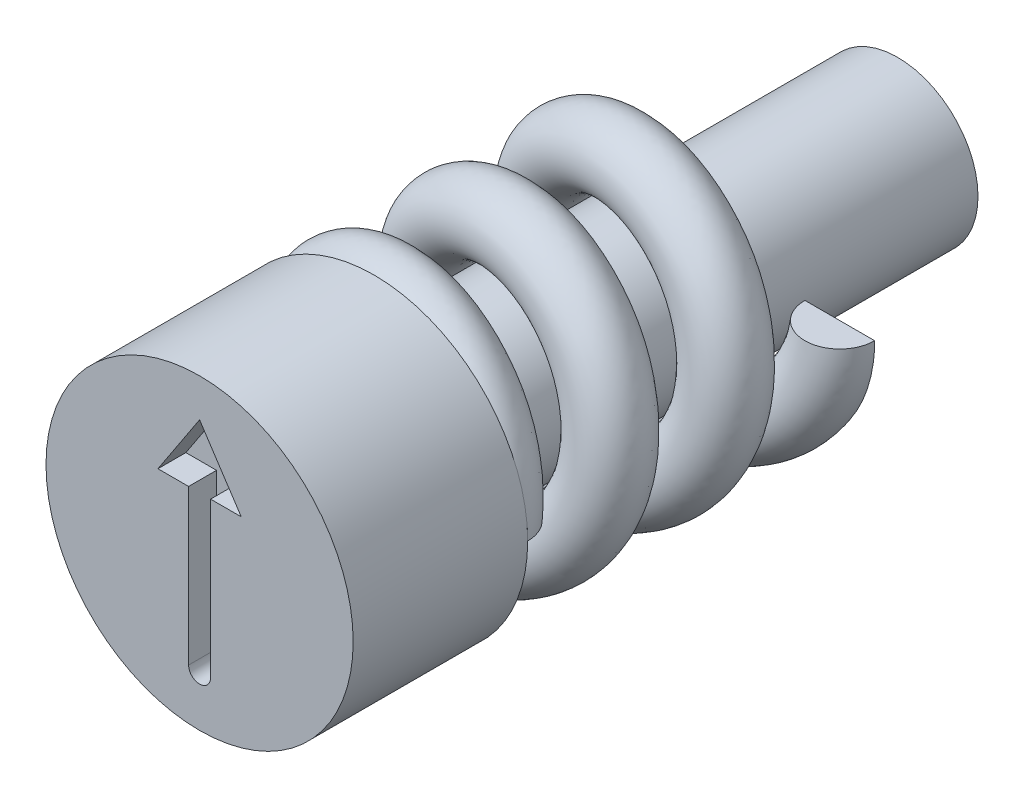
ISO-10303-21;
HEADER;
FILE_DESCRIPTION(('STEP AP214'),'2;1');
FILE_NAME('part.step','',(''),(''),'','','');
FILE_SCHEMA(('AUTOMOTIVE_DESIGN { 1 0 10303 214 1 1 1 1 }'));
ENDSEC;
DATA;
#1=APPLICATION_CONTEXT('core data for automotive mechanical design processes');
#2=APPLICATION_PROTOCOL_DEFINITION('international standard','automotive_design',2000,#1);
#3=PRODUCT_CONTEXT('',#1,'mechanical');
#4=PRODUCT('Part','Part','',(#3));
#5=PRODUCT_RELATED_PRODUCT_CATEGORY('part','',(#4));
#6=PRODUCT_DEFINITION_FORMATION('','',#4);
#7=PRODUCT_DEFINITION_CONTEXT('part definition',#1,'design');
#8=PRODUCT_DEFINITION('design','',#6,#7);
#9=PRODUCT_DEFINITION_SHAPE('','',#8);
#10=(LENGTH_UNIT() NAMED_UNIT(*) SI_UNIT(.MILLI.,.METRE.));
#11=(NAMED_UNIT(*) PLANE_ANGLE_UNIT() SI_UNIT($,.RADIAN.));
#12=(NAMED_UNIT(*) SI_UNIT($,.STERADIAN.) SOLID_ANGLE_UNIT());
#13=UNCERTAINTY_MEASURE_WITH_UNIT(LENGTH_MEASURE(1.E-05),#10,'distance_accuracy_value','');
#14=(GEOMETRIC_REPRESENTATION_CONTEXT(3) GLOBAL_UNCERTAINTY_ASSIGNED_CONTEXT((#13)) GLOBAL_UNIT_ASSIGNED_CONTEXT((#10,
#11,#12)) REPRESENTATION_CONTEXT('',''));
#15=CARTESIAN_POINT('',(0.,0.,0.));
#16=DIRECTION('',(0.,0.,1.));
#17=DIRECTION('',(1.,0.,0.));
#18=AXIS2_PLACEMENT_3D('',#15,#16,#17);
#19=CARTESIAN_POINT('',(1.7,0.,-7.97));
#20=DIRECTION('',(0.,-1.,0.));
#21=DIRECTION('',(0.,0.,-1.));
#22=AXIS2_PLACEMENT_3D('',#19,#20,#21);
#23=PLANE('',#22);
#24=CARTESIAN_POINT('',(1.7,0.,-7.47));
#25=DIRECTION('',(0.,1.,0.));
#26=DIRECTION('',(0.,0.,1.));
#27=AXIS2_PLACEMENT_3D('',#24,#25,#26);
#28=CIRCLE('',#27,0.5);
#29=CARTESIAN_POINT('',(1.2,0.,-7.47));
#30=VERTEX_POINT('',#29);
#31=CARTESIAN_POINT('',(2.2,0.,-7.47));
#32=VERTEX_POINT('',#31);
#33=EDGE_CURVE('E88',#30,#32,#28,.T.);
#34=ORIENTED_EDGE('',*,*,#33,.T.);
#35=DIRECTION('',(-1.,0.,0.));
#36=VECTOR('',#35,1.);
#37=CARTESIAN_POINT('',(1.7,0.,-7.47));
#38=LINE('',#37,#36);
#39=EDGE_CURVE('E75',#32,#30,#38,.T.);
#40=ORIENTED_EDGE('',*,*,#39,.T.);
#41=EDGE_LOOP('',(#34,#40));
#42=FACE_BOUND('',#41,.T.);
#43=ADVANCED_FACE('F49',(#42),#23,.F.);
#44=CARTESIAN_POINT('',(1.7,0.,-3.));
#45=DIRECTION('',(0.,-1.,0.));
#46=DIRECTION('',(0.,0.,-1.));
#47=AXIS2_PLACEMENT_3D('',#44,#45,#46);
#48=PLANE('',#47);
#49=DIRECTION('',(1.,0.,0.));
#50=VECTOR('',#49,1.);
#51=CARTESIAN_POINT('',(1.7,0.,-2.5));
#52=LINE('',#51,#50);
#53=CARTESIAN_POINT('',(1.2,0.,-2.5));
#54=VERTEX_POINT('',#53);
#55=CARTESIAN_POINT('',(2.2,0.,-2.5));
#56=VERTEX_POINT('',#55);
#57=EDGE_CURVE('E69',#54,#56,#52,.T.);
#58=ORIENTED_EDGE('',*,*,#57,.F.);
#59=CARTESIAN_POINT('',(1.7,0.,-2.5));
#60=DIRECTION('',(0.,-1.,0.));
#61=DIRECTION('',(0.,0.,-1.));
#62=AXIS2_PLACEMENT_3D('',#59,#60,#61);
#63=CIRCLE('',#62,0.5);
#64=EDGE_CURVE('E85',#54,#56,#63,.T.);
#65=ORIENTED_EDGE('',*,*,#64,.T.);
#66=EDGE_LOOP('',(#58,#65));
#67=FACE_BOUND('',#66,.T.);
#68=ADVANCED_FACE('F51',(#67),#48,.T.);
#69=CARTESIAN_POINT('',(1.7,0.,-6.97));
#70=CARTESIAN_POINT('',(1.7,-0.704163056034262,-6.86645833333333));
#71=CARTESIAN_POINT('',(1.20208152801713,-1.20208152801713,-6.76291666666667));
#72=CARTESIAN_POINT('',(0.704163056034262,-1.7,-6.659375));
#73=CARTESIAN_POINT('',(0.,-1.7,-6.55583333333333));
#74=CARTESIAN_POINT('',(-0.704163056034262,-1.7,-6.45229166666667));
#75=CARTESIAN_POINT('',(-1.20208152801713,-1.20208152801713,-6.34875));
#76=CARTESIAN_POINT('',(-1.7,-0.704163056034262,-6.24520833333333));
#77=CARTESIAN_POINT('',(-1.7,0.,-6.14166666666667));
#78=CARTESIAN_POINT('',(-1.7,0.704163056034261,-6.038125));
#79=CARTESIAN_POINT('',(-1.20208152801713,1.20208152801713,-5.93458333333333));
#80=CARTESIAN_POINT('',(-0.704163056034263,1.7,-5.83104166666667));
#81=CARTESIAN_POINT('',(0.,1.7,-5.7275));
#82=CARTESIAN_POINT('',(0.704163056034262,1.7,-5.62395833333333));
#83=CARTESIAN_POINT('',(1.20208152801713,1.20208152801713,-5.52041666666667));
#84=CARTESIAN_POINT('',(1.7,0.704163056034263,-5.416875));
#85=CARTESIAN_POINT('',(1.7,0.,-5.31333333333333));
#86=CARTESIAN_POINT('',(1.7,-0.704163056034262,-5.20979166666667));
#87=CARTESIAN_POINT('',(1.20208152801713,-1.20208152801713,-5.10625));
#88=CARTESIAN_POINT('',(0.704163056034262,-1.7,-5.00270833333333));
#89=CARTESIAN_POINT('',(0.,-1.7,-4.89916666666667));
#90=CARTESIAN_POINT('',(-0.704163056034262,-1.7,-4.795625));
#91=CARTESIAN_POINT('',(-1.20208152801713,-1.20208152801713,-4.69208333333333));
#92=CARTESIAN_POINT('',(-1.7,-0.704163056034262,-4.58854166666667));
#93=CARTESIAN_POINT('',(-1.7,0.,-4.485));
#94=CARTESIAN_POINT('',(-1.7,0.704163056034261,-4.38145833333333));
#95=CARTESIAN_POINT('',(-1.20208152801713,1.20208152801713,-4.27791666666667));
#96=CARTESIAN_POINT('',(-0.704163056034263,1.7,-4.174375));
#97=CARTESIAN_POINT('',(0.,1.7,-4.07083333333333));
#98=CARTESIAN_POINT('',(0.704163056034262,1.7,-3.96729166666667));
#99=CARTESIAN_POINT('',(1.20208152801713,1.20208152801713,-3.86375));
#100=CARTESIAN_POINT('',(1.7,0.704163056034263,-3.76020833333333));
#101=CARTESIAN_POINT('',(1.7,0.,-3.65666666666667));
#102=CARTESIAN_POINT('',(1.7,-0.704163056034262,-3.553125));
#103=CARTESIAN_POINT('',(1.20208152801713,-1.20208152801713,-3.44958333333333));
#104=CARTESIAN_POINT('',(0.704163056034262,-1.7,-3.34604166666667));
#105=CARTESIAN_POINT('',(0.,-1.7,-3.2425));
#106=CARTESIAN_POINT('',(-0.704163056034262,-1.7,-3.13895833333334));
#107=CARTESIAN_POINT('',(-1.20208152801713,-1.20208152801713,-3.03541666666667));
#108=CARTESIAN_POINT('',(-1.7,-0.704163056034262,-2.931875));
#109=CARTESIAN_POINT('',(-1.7,0.,-2.82833333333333));
#110=CARTESIAN_POINT('',(-1.7,0.704163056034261,-2.72479166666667));
#111=CARTESIAN_POINT('',(-1.20208152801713,1.20208152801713,-2.62125));
#112=CARTESIAN_POINT('',(-0.704163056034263,1.7,-2.51770833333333));
#113=CARTESIAN_POINT('',(0.,1.7,-2.41416666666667));
#114=CARTESIAN_POINT('',(0.704163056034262,1.7,-2.310625));
#115=CARTESIAN_POINT('',(1.20208152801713,1.20208152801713,-2.20708333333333));
#116=CARTESIAN_POINT('',(1.7,0.704163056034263,-2.10354166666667));
#117=CARTESIAN_POINT('',(1.7,0.,-2.));
#118=CARTESIAN_POINT('',(2.7,0.,-6.97));
#119=CARTESIAN_POINT('',(2.7,-1.11837661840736,-6.86645833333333));
#120=CARTESIAN_POINT('',(1.90918830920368,-1.90918830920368,-6.76291666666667));
#121=CARTESIAN_POINT('',(1.11837661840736,-2.7,-6.659375));
#122=CARTESIAN_POINT('',(0.,-2.7,-6.55583333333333));
#123=CARTESIAN_POINT('',(-1.11837661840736,-2.7,-6.45229166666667));
#124=CARTESIAN_POINT('',(-1.90918830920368,-1.90918830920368,-6.34875));
#125=CARTESIAN_POINT('',(-2.7,-1.11837661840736,-6.24520833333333));
#126=CARTESIAN_POINT('',(-2.7,0.,-6.14166666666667));
#127=CARTESIAN_POINT('',(-2.7,1.11837661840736,-6.038125));
#128=CARTESIAN_POINT('',(-1.90918830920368,1.90918830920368,-5.93458333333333));
#129=CARTESIAN_POINT('',(-1.11837661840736,2.7,-5.83104166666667));
#130=CARTESIAN_POINT('',(0.,2.7,-5.7275));
#131=CARTESIAN_POINT('',(1.11837661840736,2.7,-5.62395833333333));
#132=CARTESIAN_POINT('',(1.90918830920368,1.90918830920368,-5.52041666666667));
#133=CARTESIAN_POINT('',(2.7,1.11837661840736,-5.416875));
#134=CARTESIAN_POINT('',(2.7,0.,-5.31333333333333));
#135=CARTESIAN_POINT('',(2.7,-1.11837661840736,-5.20979166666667));
#136=CARTESIAN_POINT('',(1.90918830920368,-1.90918830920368,-5.10625));
#137=CARTESIAN_POINT('',(1.11837661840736,-2.7,-5.00270833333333));
#138=CARTESIAN_POINT('',(0.,-2.7,-4.89916666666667));
#139=CARTESIAN_POINT('',(-1.11837661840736,-2.7,-4.795625));
#140=CARTESIAN_POINT('',(-1.90918830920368,-1.90918830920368,-4.69208333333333));
#141=CARTESIAN_POINT('',(-2.7,-1.11837661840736,-4.58854166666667));
#142=CARTESIAN_POINT('',(-2.7,0.,-4.485));
#143=CARTESIAN_POINT('',(-2.7,1.11837661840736,-4.38145833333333));
#144=CARTESIAN_POINT('',(-1.90918830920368,1.90918830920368,-4.27791666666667));
#145=CARTESIAN_POINT('',(-1.11837661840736,2.7,-4.174375));
#146=CARTESIAN_POINT('',(0.,2.7,-4.07083333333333));
#147=CARTESIAN_POINT('',(1.11837661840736,2.7,-3.96729166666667));
#148=CARTESIAN_POINT('',(1.90918830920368,1.90918830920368,-3.86375));
#149=CARTESIAN_POINT('',(2.7,1.11837661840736,-3.76020833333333));
#150=CARTESIAN_POINT('',(2.7,0.,-3.65666666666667));
#151=CARTESIAN_POINT('',(2.7,-1.11837661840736,-3.553125));
#152=CARTESIAN_POINT('',(1.90918830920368,-1.90918830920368,-3.44958333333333));
#153=CARTESIAN_POINT('',(1.11837661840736,-2.7,-3.34604166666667));
#154=CARTESIAN_POINT('',(0.,-2.7,-3.2425));
#155=CARTESIAN_POINT('',(-1.11837661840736,-2.7,-3.13895833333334));
#156=CARTESIAN_POINT('',(-1.90918830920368,-1.90918830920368,-3.03541666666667));
#157=CARTESIAN_POINT('',(-2.7,-1.11837661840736,-2.931875));
#158=CARTESIAN_POINT('',(-2.7,0.,-2.82833333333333));
#159=CARTESIAN_POINT('',(-2.7,1.11837661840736,-2.72479166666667));
#160=CARTESIAN_POINT('',(-1.90918830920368,1.90918830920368,-2.62125));
#161=CARTESIAN_POINT('',(-1.11837661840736,2.7,-2.51770833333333));
#162=CARTESIAN_POINT('',(0.,2.7,-2.41416666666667));
#163=CARTESIAN_POINT('',(1.11837661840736,2.7,-2.310625));
#164=CARTESIAN_POINT('',(1.90918830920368,1.90918830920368,-2.20708333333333));
#165=CARTESIAN_POINT('',(2.7,1.11837661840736,-2.10354166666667));
#166=CARTESIAN_POINT('',(2.7,0.,-2.));
#167=CARTESIAN_POINT('',(2.7,0.,-7.97));
#168=CARTESIAN_POINT('',(2.7,-1.11837661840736,-7.86645833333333));
#169=CARTESIAN_POINT('',(1.90918830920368,-1.90918830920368,-7.76291666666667));
#170=CARTESIAN_POINT('',(1.11837661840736,-2.7,-7.659375));
#171=CARTESIAN_POINT('',(0.,-2.7,-7.55583333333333));
#172=CARTESIAN_POINT('',(-1.11837661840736,-2.7,-7.45229166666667));
#173=CARTESIAN_POINT('',(-1.90918830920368,-1.90918830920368,-7.34875));
#174=CARTESIAN_POINT('',(-2.7,-1.11837661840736,-7.24520833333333));
#175=CARTESIAN_POINT('',(-2.7,0.,-7.14166666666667));
#176=CARTESIAN_POINT('',(-2.7,1.11837661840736,-7.038125));
#177=CARTESIAN_POINT('',(-1.90918830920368,1.90918830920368,-6.93458333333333));
#178=CARTESIAN_POINT('',(-1.11837661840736,2.7,-6.83104166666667));
#179=CARTESIAN_POINT('',(0.,2.7,-6.7275));
#180=CARTESIAN_POINT('',(1.11837661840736,2.7,-6.62395833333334));
#181=CARTESIAN_POINT('',(1.90918830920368,1.90918830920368,-6.52041666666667));
#182=CARTESIAN_POINT('',(2.7,1.11837661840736,-6.416875));
#183=CARTESIAN_POINT('',(2.7,0.,-6.31333333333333));
#184=CARTESIAN_POINT('',(2.7,-1.11837661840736,-6.20979166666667));
#185=CARTESIAN_POINT('',(1.90918830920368,-1.90918830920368,-6.10625));
#186=CARTESIAN_POINT('',(1.11837661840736,-2.7,-6.00270833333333));
#187=CARTESIAN_POINT('',(0.,-2.7,-5.89916666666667));
#188=CARTESIAN_POINT('',(-1.11837661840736,-2.7,-5.795625));
#189=CARTESIAN_POINT('',(-1.90918830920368,-1.90918830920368,-5.69208333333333));
#190=CARTESIAN_POINT('',(-2.7,-1.11837661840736,-5.58854166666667));
#191=CARTESIAN_POINT('',(-2.7,0.,-5.485));
#192=CARTESIAN_POINT('',(-2.7,1.11837661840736,-5.38145833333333));
#193=CARTESIAN_POINT('',(-1.90918830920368,1.90918830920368,-5.27791666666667));
#194=CARTESIAN_POINT('',(-1.11837661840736,2.7,-5.174375));
#195=CARTESIAN_POINT('',(0.,2.7,-5.07083333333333));
#196=CARTESIAN_POINT('',(1.11837661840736,2.7,-4.96729166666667));
#197=CARTESIAN_POINT('',(1.90918830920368,1.90918830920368,-4.86375));
#198=CARTESIAN_POINT('',(2.7,1.11837661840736,-4.76020833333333));
#199=CARTESIAN_POINT('',(2.7,0.,-4.65666666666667));
#200=CARTESIAN_POINT('',(2.7,-1.11837661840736,-4.553125));
#201=CARTESIAN_POINT('',(1.90918830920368,-1.90918830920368,-4.44958333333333));
#202=CARTESIAN_POINT('',(1.11837661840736,-2.7,-4.34604166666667));
#203=CARTESIAN_POINT('',(0.,-2.7,-4.2425));
#204=CARTESIAN_POINT('',(-1.11837661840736,-2.7,-4.13895833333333));
#205=CARTESIAN_POINT('',(-1.90918830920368,-1.90918830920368,-4.03541666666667));
#206=CARTESIAN_POINT('',(-2.7,-1.11837661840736,-3.931875));
#207=CARTESIAN_POINT('',(-2.7,0.,-3.82833333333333));
#208=CARTESIAN_POINT('',(-2.7,1.11837661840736,-3.72479166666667));
#209=CARTESIAN_POINT('',(-1.90918830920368,1.90918830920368,-3.62125));
#210=CARTESIAN_POINT('',(-1.11837661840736,2.7,-3.51770833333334));
#211=CARTESIAN_POINT('',(0.,2.7,-3.41416666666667));
#212=CARTESIAN_POINT('',(1.11837661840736,2.7,-3.310625));
#213=CARTESIAN_POINT('',(1.90918830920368,1.90918830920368,-3.20708333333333));
#214=CARTESIAN_POINT('',(2.7,1.11837661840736,-3.10354166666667));
#215=CARTESIAN_POINT('',(2.7,0.,-3.));
#216=CARTESIAN_POINT('',(1.7,0.,-7.97));
#217=CARTESIAN_POINT('',(1.7,-0.704163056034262,-7.86645833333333));
#218=CARTESIAN_POINT('',(1.20208152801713,-1.20208152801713,-7.76291666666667));
#219=CARTESIAN_POINT('',(0.704163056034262,-1.7,-7.659375));
#220=CARTESIAN_POINT('',(0.,-1.7,-7.55583333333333));
#221=CARTESIAN_POINT('',(-0.704163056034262,-1.7,-7.45229166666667));
#222=CARTESIAN_POINT('',(-1.20208152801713,-1.20208152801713,-7.34875));
#223=CARTESIAN_POINT('',(-1.7,-0.704163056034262,-7.24520833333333));
#224=CARTESIAN_POINT('',(-1.7,0.,-7.14166666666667));
#225=CARTESIAN_POINT('',(-1.7,0.704163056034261,-7.038125));
#226=CARTESIAN_POINT('',(-1.20208152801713,1.20208152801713,-6.93458333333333));
#227=CARTESIAN_POINT('',(-0.704163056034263,1.7,-6.83104166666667));
#228=CARTESIAN_POINT('',(0.,1.7,-6.7275));
#229=CARTESIAN_POINT('',(0.704163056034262,1.7,-6.62395833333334));
#230=CARTESIAN_POINT('',(1.20208152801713,1.20208152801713,-6.52041666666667));
#231=CARTESIAN_POINT('',(1.7,0.704163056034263,-6.416875));
#232=CARTESIAN_POINT('',(1.7,0.,-6.31333333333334));
#233=CARTESIAN_POINT('',(1.7,-0.704163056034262,-6.20979166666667));
#234=CARTESIAN_POINT('',(1.20208152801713,-1.20208152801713,-6.10625));
#235=CARTESIAN_POINT('',(0.704163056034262,-1.7,-6.00270833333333));
#236=CARTESIAN_POINT('',(0.,-1.7,-5.89916666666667));
#237=CARTESIAN_POINT('',(-0.704163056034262,-1.7,-5.795625));
#238=CARTESIAN_POINT('',(-1.20208152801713,-1.20208152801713,-5.69208333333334));
#239=CARTESIAN_POINT('',(-1.7,-0.704163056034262,-5.58854166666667));
#240=CARTESIAN_POINT('',(-1.7,0.,-5.485));
#241=CARTESIAN_POINT('',(-1.7,0.704163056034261,-5.38145833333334));
#242=CARTESIAN_POINT('',(-1.20208152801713,1.20208152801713,-5.27791666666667));
#243=CARTESIAN_POINT('',(-0.704163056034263,1.7,-5.174375));
#244=CARTESIAN_POINT('',(0.,1.7,-5.07083333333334));
#245=CARTESIAN_POINT('',(0.704163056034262,1.7,-4.96729166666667));
#246=CARTESIAN_POINT('',(1.20208152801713,1.20208152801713,-4.86375));
#247=CARTESIAN_POINT('',(1.7,0.704163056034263,-4.76020833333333));
#248=CARTESIAN_POINT('',(1.7,0.,-4.65666666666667));
#249=CARTESIAN_POINT('',(1.7,-0.704163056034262,-4.553125));
#250=CARTESIAN_POINT('',(1.20208152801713,-1.20208152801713,-4.44958333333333));
#251=CARTESIAN_POINT('',(0.704163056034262,-1.7,-4.34604166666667));
#252=CARTESIAN_POINT('',(0.,-1.7,-4.2425));
#253=CARTESIAN_POINT('',(-0.704163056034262,-1.7,-4.13895833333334));
#254=CARTESIAN_POINT('',(-1.20208152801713,-1.20208152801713,-4.03541666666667));
#255=CARTESIAN_POINT('',(-1.7,-0.704163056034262,-3.931875));
#256=CARTESIAN_POINT('',(-1.7,0.,-3.82833333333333));
#257=CARTESIAN_POINT('',(-1.7,0.704163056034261,-3.72479166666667));
#258=CARTESIAN_POINT('',(-1.20208152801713,1.20208152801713,-3.62125));
#259=CARTESIAN_POINT('',(-0.704163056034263,1.7,-3.51770833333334));
#260=CARTESIAN_POINT('',(0.,1.7,-3.41416666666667));
#261=CARTESIAN_POINT('',(0.704163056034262,1.7,-3.310625));
#262=CARTESIAN_POINT('',(1.20208152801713,1.20208152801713,-3.20708333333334));
#263=CARTESIAN_POINT('',(1.7,0.704163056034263,-3.10354166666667));
#264=CARTESIAN_POINT('',(1.7,0.,-3.));
#265=CARTESIAN_POINT('',(0.7,0.,-7.97));
#266=CARTESIAN_POINT('',(0.7,-0.289949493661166,-7.86645833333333));
#267=CARTESIAN_POINT('',(0.494974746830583,-0.494974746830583,-7.76291666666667));
#268=CARTESIAN_POINT('',(0.289949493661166,-0.7,-7.659375));
#269=CARTESIAN_POINT('',(0.,-0.7,-7.55583333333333));
#270=CARTESIAN_POINT('',(-0.289949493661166,-0.7,-7.45229166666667));
#271=CARTESIAN_POINT('',(-0.494974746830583,-0.494974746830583,-7.34875));
#272=CARTESIAN_POINT('',(-0.7,-0.289949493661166,-7.24520833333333));
#273=CARTESIAN_POINT('',(-0.7,0.,-7.14166666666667));
#274=CARTESIAN_POINT('',(-0.7,0.289949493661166,-7.038125));
#275=CARTESIAN_POINT('',(-0.494974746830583,0.494974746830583,-6.93458333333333));
#276=CARTESIAN_POINT('',(-0.289949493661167,0.7,-6.83104166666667));
#277=CARTESIAN_POINT('',(0.,0.7,-6.7275));
#278=CARTESIAN_POINT('',(0.289949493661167,0.7,-6.62395833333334));
#279=CARTESIAN_POINT('',(0.494974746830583,0.494974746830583,-6.52041666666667));
#280=CARTESIAN_POINT('',(0.7,0.289949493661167,-6.416875));
#281=CARTESIAN_POINT('',(0.7,0.,-6.31333333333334));
#282=CARTESIAN_POINT('',(0.7,-0.289949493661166,-6.20979166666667));
#283=CARTESIAN_POINT('',(0.494974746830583,-0.494974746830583,-6.10625));
#284=CARTESIAN_POINT('',(0.289949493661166,-0.7,-6.00270833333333));
#285=CARTESIAN_POINT('',(0.,-0.7,-5.89916666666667));
#286=CARTESIAN_POINT('',(-0.289949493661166,-0.7,-5.795625));
#287=CARTESIAN_POINT('',(-0.494974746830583,-0.494974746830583,-5.69208333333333));
#288=CARTESIAN_POINT('',(-0.7,-0.289949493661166,-5.58854166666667));
#289=CARTESIAN_POINT('',(-0.7,0.,-5.485));
#290=CARTESIAN_POINT('',(-0.7,0.289949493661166,-5.38145833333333));
#291=CARTESIAN_POINT('',(-0.494974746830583,0.494974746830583,-5.27791666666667));
#292=CARTESIAN_POINT('',(-0.289949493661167,0.7,-5.174375));
#293=CARTESIAN_POINT('',(0.,0.7,-5.07083333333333));
#294=CARTESIAN_POINT('',(0.289949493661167,0.7,-4.96729166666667));
#295=CARTESIAN_POINT('',(0.494974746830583,0.494974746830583,-4.86375));
#296=CARTESIAN_POINT('',(0.7,0.289949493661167,-4.76020833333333));
#297=CARTESIAN_POINT('',(0.7,0.,-4.65666666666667));
#298=CARTESIAN_POINT('',(0.7,-0.289949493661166,-4.553125));
#299=CARTESIAN_POINT('',(0.494974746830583,-0.494974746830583,-4.44958333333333));
#300=CARTESIAN_POINT('',(0.289949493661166,-0.7,-4.34604166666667));
#301=CARTESIAN_POINT('',(0.,-0.7,-4.2425));
#302=CARTESIAN_POINT('',(-0.289949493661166,-0.7,-4.13895833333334));
#303=CARTESIAN_POINT('',(-0.494974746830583,-0.494974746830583,-4.03541666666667));
#304=CARTESIAN_POINT('',(-0.7,-0.289949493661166,-3.931875));
#305=CARTESIAN_POINT('',(-0.7,0.,-3.82833333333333));
#306=CARTESIAN_POINT('',(-0.7,0.289949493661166,-3.72479166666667));
#307=CARTESIAN_POINT('',(-0.494974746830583,0.494974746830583,-3.62125));
#308=CARTESIAN_POINT('',(-0.289949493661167,0.7,-3.51770833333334));
#309=CARTESIAN_POINT('',(0.,0.7,-3.41416666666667));
#310=CARTESIAN_POINT('',(0.289949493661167,0.7,-3.310625));
#311=CARTESIAN_POINT('',(0.494974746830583,0.494974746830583,-3.20708333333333));
#312=CARTESIAN_POINT('',(0.7,0.289949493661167,-3.10354166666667));
#313=CARTESIAN_POINT('',(0.7,0.,-3.));
#314=CARTESIAN_POINT('',(0.7,0.,-6.97));
#315=CARTESIAN_POINT('',(0.7,-0.289949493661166,-6.86645833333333));
#316=CARTESIAN_POINT('',(0.494974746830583,-0.494974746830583,-6.76291666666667));
#317=CARTESIAN_POINT('',(0.289949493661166,-0.7,-6.659375));
#318=CARTESIAN_POINT('',(0.,-0.7,-6.55583333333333));
#319=CARTESIAN_POINT('',(-0.289949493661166,-0.7,-6.45229166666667));
#320=CARTESIAN_POINT('',(-0.494974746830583,-0.494974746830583,-6.34875));
#321=CARTESIAN_POINT('',(-0.7,-0.289949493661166,-6.24520833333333));
#322=CARTESIAN_POINT('',(-0.7,0.,-6.14166666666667));
#323=CARTESIAN_POINT('',(-0.7,0.289949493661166,-6.038125));
#324=CARTESIAN_POINT('',(-0.494974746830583,0.494974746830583,-5.93458333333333));
#325=CARTESIAN_POINT('',(-0.289949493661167,0.7,-5.83104166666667));
#326=CARTESIAN_POINT('',(0.,0.7,-5.7275));
#327=CARTESIAN_POINT('',(0.289949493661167,0.7,-5.62395833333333));
#328=CARTESIAN_POINT('',(0.494974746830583,0.494974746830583,-5.52041666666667));
#329=CARTESIAN_POINT('',(0.7,0.289949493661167,-5.416875));
#330=CARTESIAN_POINT('',(0.7,0.,-5.31333333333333));
#331=CARTESIAN_POINT('',(0.7,-0.289949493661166,-5.20979166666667));
#332=CARTESIAN_POINT('',(0.494974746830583,-0.494974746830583,-5.10625));
#333=CARTESIAN_POINT('',(0.289949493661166,-0.7,-5.00270833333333));
#334=CARTESIAN_POINT('',(0.,-0.7,-4.89916666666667));
#335=CARTESIAN_POINT('',(-0.289949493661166,-0.7,-4.795625));
#336=CARTESIAN_POINT('',(-0.494974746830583,-0.494974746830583,-4.69208333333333));
#337=CARTESIAN_POINT('',(-0.7,-0.289949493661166,-4.58854166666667));
#338=CARTESIAN_POINT('',(-0.7,0.,-4.485));
#339=CARTESIAN_POINT('',(-0.7,0.289949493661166,-4.38145833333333));
#340=CARTESIAN_POINT('',(-0.494974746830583,0.494974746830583,-4.27791666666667));
#341=CARTESIAN_POINT('',(-0.289949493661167,0.7,-4.174375));
#342=CARTESIAN_POINT('',(0.,0.7,-4.07083333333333));
#343=CARTESIAN_POINT('',(0.289949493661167,0.7,-3.96729166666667));
#344=CARTESIAN_POINT('',(0.494974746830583,0.494974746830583,-3.86375));
#345=CARTESIAN_POINT('',(0.7,0.289949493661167,-3.76020833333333));
#346=CARTESIAN_POINT('',(0.7,0.,-3.65666666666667));
#347=CARTESIAN_POINT('',(0.7,-0.289949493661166,-3.553125));
#348=CARTESIAN_POINT('',(0.494974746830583,-0.494974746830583,-3.44958333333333));
#349=CARTESIAN_POINT('',(0.289949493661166,-0.7,-3.34604166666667));
#350=CARTESIAN_POINT('',(0.,-0.7,-3.2425));
#351=CARTESIAN_POINT('',(-0.289949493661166,-0.7,-3.13895833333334));
#352=CARTESIAN_POINT('',(-0.494974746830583,-0.494974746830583,-3.03541666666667));
#353=CARTESIAN_POINT('',(-0.7,-0.289949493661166,-2.931875));
#354=CARTESIAN_POINT('',(-0.7,0.,-2.82833333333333));
#355=CARTESIAN_POINT('',(-0.7,0.289949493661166,-2.72479166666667));
#356=CARTESIAN_POINT('',(-0.494974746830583,0.494974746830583,-2.62125));
#357=CARTESIAN_POINT('',(-0.289949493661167,0.7,-2.51770833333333));
#358=CARTESIAN_POINT('',(0.,0.7,-2.41416666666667));
#359=CARTESIAN_POINT('',(0.289949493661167,0.7,-2.310625));
#360=CARTESIAN_POINT('',(0.494974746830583,0.494974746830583,-2.20708333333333));
#361=CARTESIAN_POINT('',(0.7,0.289949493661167,-2.10354166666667));
#362=CARTESIAN_POINT('',(0.7,0.,-2.));
#363=CARTESIAN_POINT('',(1.7,0.,-6.97));
#364=CARTESIAN_POINT('',(1.7,-0.704163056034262,-6.86645833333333));
#365=CARTESIAN_POINT('',(1.20208152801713,-1.20208152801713,-6.76291666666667));
#366=CARTESIAN_POINT('',(0.704163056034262,-1.7,-6.659375));
#367=CARTESIAN_POINT('',(0.,-1.7,-6.55583333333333));
#368=CARTESIAN_POINT('',(-0.704163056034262,-1.7,-6.45229166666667));
#369=CARTESIAN_POINT('',(-1.20208152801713,-1.20208152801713,-6.34875));
#370=CARTESIAN_POINT('',(-1.7,-0.704163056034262,-6.24520833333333));
#371=CARTESIAN_POINT('',(-1.7,0.,-6.14166666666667));
#372=CARTESIAN_POINT('',(-1.7,0.704163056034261,-6.038125));
#373=CARTESIAN_POINT('',(-1.20208152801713,1.20208152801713,-5.93458333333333));
#374=CARTESIAN_POINT('',(-0.704163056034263,1.7,-5.83104166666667));
#375=CARTESIAN_POINT('',(0.,1.7,-5.7275));
#376=CARTESIAN_POINT('',(0.704163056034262,1.7,-5.62395833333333));
#377=CARTESIAN_POINT('',(1.20208152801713,1.20208152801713,-5.52041666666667));
#378=CARTESIAN_POINT('',(1.7,0.704163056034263,-5.416875));
#379=CARTESIAN_POINT('',(1.7,0.,-5.31333333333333));
#380=CARTESIAN_POINT('',(1.7,-0.704163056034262,-5.20979166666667));
#381=CARTESIAN_POINT('',(1.20208152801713,-1.20208152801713,-5.10625));
#382=CARTESIAN_POINT('',(0.704163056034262,-1.7,-5.00270833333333));
#383=CARTESIAN_POINT('',(0.,-1.7,-4.89916666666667));
#384=CARTESIAN_POINT('',(-0.704163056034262,-1.7,-4.795625));
#385=CARTESIAN_POINT('',(-1.20208152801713,-1.20208152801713,-4.69208333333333));
#386=CARTESIAN_POINT('',(-1.7,-0.704163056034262,-4.58854166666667));
#387=CARTESIAN_POINT('',(-1.7,0.,-4.485));
#388=CARTESIAN_POINT('',(-1.7,0.704163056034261,-4.38145833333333));
#389=CARTESIAN_POINT('',(-1.20208152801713,1.20208152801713,-4.27791666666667));
#390=CARTESIAN_POINT('',(-0.704163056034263,1.7,-4.174375));
#391=CARTESIAN_POINT('',(0.,1.7,-4.07083333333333));
#392=CARTESIAN_POINT('',(0.704163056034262,1.7,-3.96729166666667));
#393=CARTESIAN_POINT('',(1.20208152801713,1.20208152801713,-3.86375));
#394=CARTESIAN_POINT('',(1.7,0.704163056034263,-3.76020833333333));
#395=CARTESIAN_POINT('',(1.7,0.,-3.65666666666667));
#396=CARTESIAN_POINT('',(1.7,-0.704163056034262,-3.553125));
#397=CARTESIAN_POINT('',(1.20208152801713,-1.20208152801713,-3.44958333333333));
#398=CARTESIAN_POINT('',(0.704163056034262,-1.7,-3.34604166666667));
#399=CARTESIAN_POINT('',(0.,-1.7,-3.2425));
#400=CARTESIAN_POINT('',(-0.704163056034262,-1.7,-3.13895833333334));
#401=CARTESIAN_POINT('',(-1.20208152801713,-1.20208152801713,-3.03541666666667));
#402=CARTESIAN_POINT('',(-1.7,-0.704163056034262,-2.931875));
#403=CARTESIAN_POINT('',(-1.7,0.,-2.82833333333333));
#404=CARTESIAN_POINT('',(-1.7,0.704163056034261,-2.72479166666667));
#405=CARTESIAN_POINT('',(-1.20208152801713,1.20208152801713,-2.62125));
#406=CARTESIAN_POINT('',(-0.704163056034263,1.7,-2.51770833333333));
#407=CARTESIAN_POINT('',(0.,1.7,-2.41416666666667));
#408=CARTESIAN_POINT('',(0.704163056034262,1.7,-2.310625));
#409=CARTESIAN_POINT('',(1.20208152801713,1.20208152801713,-2.20708333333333));
#410=CARTESIAN_POINT('',(1.7,0.704163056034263,-2.10354166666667));
#411=CARTESIAN_POINT('',(1.7,0.,-2.));
#412=(BOUNDED_SURFACE() B_SPLINE_SURFACE(3,2,((#69,#70,#71,#72,#73,#74,#75,#76,#77,#78,#79,#80,
#81,#82,#83,#84,#85,#86,#87,#88,#89,#90,#91,#92,#93,#94,#95,#96,#97,#98,#99,#100,#101,#102,#103,
#104,#105,#106,#107,#108,#109,#110,#111,#112,#113,#114,#115,#116,#117),(#118,#119,#120,#121,
#122,#123,#124,#125,#126,#127,#128,#129,#130,#131,#132,#133,#134,#135,#136,#137,#138,#139,#140,
#141,#142,#143,#144,#145,#146,#147,#148,#149,#150,#151,#152,#153,#154,#155,#156,#157,#158,#159,
#160,#161,#162,#163,#164,#165,#166),(#167,#168,#169,#170,#171,#172,#173,#174,#175,#176,#177,
#178,#179,#180,#181,#182,#183,#184,#185,#186,#187,#188,#189,#190,#191,#192,#193,#194,#195,#196,
#197,#198,#199,#200,#201,#202,#203,#204,#205,#206,#207,#208,#209,#210,#211,#212,#213,#214,#215),
(#216,#217,#218,#219,#220,#221,#222,#223,#224,#225,#226,#227,#228,#229,#230,#231,#232,#233,#234,
#235,#236,#237,#238,#239,#240,#241,#242,#243,#244,#245,#246,#247,#248,#249,#250,#251,#252,#253,
#254,#255,#256,#257,#258,#259,#260,#261,#262,#263,#264),(#265,#266,#267,#268,#269,#270,#271,
#272,#273,#274,#275,#276,#277,#278,#279,#280,#281,#282,#283,#284,#285,#286,#287,#288,#289,#290,
#291,#292,#293,#294,#295,#296,#297,#298,#299,#300,#301,#302,#303,#304,#305,#306,#307,#308,#309,
#310,#311,#312,#313),(#314,#315,#316,#317,#318,#319,#320,#321,#322,#323,#324,#325,#326,#327,
#328,#329,#330,#331,#332,#333,#334,#335,#336,#337,#338,#339,#340,#341,#342,#343,#344,#345,#346,
#347,#348,#349,#350,#351,#352,#353,#354,#355,#356,#357,#358,#359,#360,#361,#362),(#363,#364,
#365,#366,#367,#368,#369,#370,#371,#372,#373,#374,#375,#376,#377,#378,#379,#380,#381,#382,#383,
#384,#385,#386,#387,#388,#389,#390,#391,#392,#393,#394,#395,#396,#397,#398,#399,#400,#401,#402,
#403,#404,#405,#406,#407,#408,#409,#410,#411)),.UNSPECIFIED.,.T.,.F.,
.F.) B_SPLINE_SURFACE_WITH_KNOTS((4,3,4),(3,2,2,2,2,2,2,2,2,2,2,2,2,2,2,2,2,2,2,2,2,2,2,2,3),
(0.,0.5,1.),(0.,0.0416666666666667,0.0833333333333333,0.125,0.166666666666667,0.208333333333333,
0.25,0.291666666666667,0.333333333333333,0.375,0.416666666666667,0.458333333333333,0.5,
0.541666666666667,0.583333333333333,0.625,0.666666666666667,0.708333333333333,0.75,
0.791666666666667,0.833333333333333,0.875,0.916666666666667,0.958333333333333,1.),
.UNSPECIFIED.) GEOMETRIC_REPRESENTATION_ITEM() RATIONAL_B_SPLINE_SURFACE(((1.,0.923879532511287,
1.,0.923879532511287,1.,0.923879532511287,1.,0.923879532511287,1.,0.923879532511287,1.,
0.923879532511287,1.,0.923879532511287,1.,0.923879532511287,1.,0.923879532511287,1.,
0.923879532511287,1.,0.923879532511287,1.,0.923879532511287,1.,0.923879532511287,1.,
0.923879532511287,1.,0.923879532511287,1.,0.923879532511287,1.,0.923879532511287,1.,
0.923879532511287,1.,0.923879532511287,1.,0.923879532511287,1.,0.923879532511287,1.,
0.923879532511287,1.,0.923879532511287,1.,0.923879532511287,1.),(0.333333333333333,
0.307959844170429,0.333333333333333,0.307959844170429,0.333333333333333,0.307959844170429,
0.333333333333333,0.307959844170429,0.333333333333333,0.307959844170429,0.333333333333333,
0.307959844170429,0.333333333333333,0.307959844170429,0.333333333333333,0.307959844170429,
0.333333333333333,0.307959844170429,0.333333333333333,0.307959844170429,0.333333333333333,
0.307959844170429,0.333333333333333,0.307959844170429,0.333333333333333,0.307959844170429,
0.333333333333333,0.307959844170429,0.333333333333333,0.307959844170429,0.333333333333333,
0.307959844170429,0.333333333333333,0.307959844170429,0.333333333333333,0.307959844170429,
0.333333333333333,0.307959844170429,0.333333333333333,0.307959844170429,0.333333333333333,
0.307959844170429,0.333333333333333,0.307959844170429,0.333333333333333,0.307959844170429,
0.333333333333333,0.307959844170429,0.333333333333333),(0.333333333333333,0.307959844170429,
0.333333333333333,0.307959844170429,0.333333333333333,0.307959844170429,0.333333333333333,
0.307959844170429,0.333333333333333,0.307959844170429,0.333333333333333,0.307959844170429,
0.333333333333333,0.307959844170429,0.333333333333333,0.307959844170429,0.333333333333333,
0.307959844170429,0.333333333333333,0.307959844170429,0.333333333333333,0.307959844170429,
0.333333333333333,0.307959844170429,0.333333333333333,0.307959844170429,0.333333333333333,
0.307959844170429,0.333333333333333,0.307959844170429,0.333333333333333,0.307959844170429,
0.333333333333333,0.307959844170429,0.333333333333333,0.307959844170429,0.333333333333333,
0.307959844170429,0.333333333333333,0.307959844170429,0.333333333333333,0.307959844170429,
0.333333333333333,0.307959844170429,0.333333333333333,0.307959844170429,0.333333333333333,
0.307959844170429,0.333333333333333),(1.,0.923879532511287,1.,0.923879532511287,1.,
0.923879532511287,1.,0.923879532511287,1.,0.923879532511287,1.,0.923879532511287,1.,
0.923879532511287,1.,0.923879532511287,1.,0.923879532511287,1.,0.923879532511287,1.,
0.923879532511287,1.,0.923879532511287,1.,0.923879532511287,1.,0.923879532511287,1.,
0.923879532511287,1.,0.923879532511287,1.,0.923879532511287,1.,0.923879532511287,1.,
0.923879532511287,1.,0.923879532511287,1.,0.923879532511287,1.,0.923879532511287,1.,
0.923879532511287,1.,0.923879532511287,1.),(0.333333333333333,0.307959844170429,
0.333333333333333,0.307959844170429,0.333333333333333,0.307959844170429,0.333333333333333,
0.307959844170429,0.333333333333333,0.307959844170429,0.333333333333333,0.307959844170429,
0.333333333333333,0.307959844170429,0.333333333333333,0.307959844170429,0.333333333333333,
0.307959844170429,0.333333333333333,0.307959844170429,0.333333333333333,0.307959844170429,
0.333333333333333,0.307959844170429,0.333333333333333,0.307959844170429,0.333333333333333,
0.307959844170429,0.333333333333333,0.307959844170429,0.333333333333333,0.307959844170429,
0.333333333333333,0.307959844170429,0.333333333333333,0.307959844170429,0.333333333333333,
0.307959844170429,0.333333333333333,0.307959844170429,0.333333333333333,0.307959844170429,
0.333333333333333,0.307959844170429,0.333333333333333,0.307959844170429,0.333333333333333,
0.307959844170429,0.333333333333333),(0.333333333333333,0.307959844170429,0.333333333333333,
0.307959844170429,0.333333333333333,0.307959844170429,0.333333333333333,0.307959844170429,
0.333333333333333,0.307959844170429,0.333333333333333,0.307959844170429,0.333333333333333,
0.307959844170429,0.333333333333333,0.307959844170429,0.333333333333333,0.307959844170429,
0.333333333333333,0.307959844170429,0.333333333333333,0.307959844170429,0.333333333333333,
0.307959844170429,0.333333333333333,0.307959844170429,0.333333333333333,0.307959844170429,
0.333333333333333,0.307959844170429,0.333333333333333,0.307959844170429,0.333333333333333,
0.307959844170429,0.333333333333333,0.307959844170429,0.333333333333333,0.307959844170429,
0.333333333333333,0.307959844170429,0.333333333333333,0.307959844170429,0.333333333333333,
0.307959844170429,0.333333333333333,0.307959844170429,0.333333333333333,0.307959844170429,
0.333333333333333),(1.,0.923879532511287,1.,0.923879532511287,1.,0.923879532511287,1.,
0.923879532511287,1.,0.923879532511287,1.,0.923879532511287,1.,0.923879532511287,1.,
0.923879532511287,1.,0.923879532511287,1.,0.923879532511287,1.,0.923879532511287,1.,
0.923879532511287,1.,0.923879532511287,1.,0.923879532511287,1.,0.923879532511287,1.,
0.923879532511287,1.,0.923879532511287,1.,0.923879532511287,1.,0.923879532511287,1.,
0.923879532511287,1.,0.923879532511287,1.,0.923879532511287,1.,0.923879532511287,1.,
0.923879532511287,1.))) REPRESENTATION_ITEM('') SURFACE());
#413=CARTESIAN_POINT('',(1.2,0.,-7.47));
#414=CARTESIAN_POINT('',(1.20002672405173,-0.0763580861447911,-7.47));
#415=CARTESIAN_POINT('',(1.19347278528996,-0.152642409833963,-7.47));
#416=CARTESIAN_POINT('',(1.16782519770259,-0.303018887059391,-7.47));
#417=CARTESIAN_POINT('',(1.14874142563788,-0.377112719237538,-7.47));
#418=CARTESIAN_POINT('',(1.09844290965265,-0.521796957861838,-7.47));
#419=CARTESIAN_POINT('',(1.06712732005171,-0.592352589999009,-7.47));
#420=CARTESIAN_POINT('',(1.01179346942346,-0.693491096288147,-7.47));
#421=CARTESIAN_POINT('',(0.991953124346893,-0.726424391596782,-7.47));
#422=CARTESIAN_POINT('',(0.949591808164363,-0.790530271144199,-7.47));
#423=CARTESIAN_POINT('',(0.927071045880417,-0.821702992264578,-7.47));
#424=CARTESIAN_POINT('',(0.879281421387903,-0.882331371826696,-7.47));
#425=CARTESIAN_POINT('',(0.853988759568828,-0.911768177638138,-7.47));
#426=CARTESIAN_POINT('',(0.801248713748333,-0.968644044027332,-7.47));
#427=CARTESIAN_POINT('',(0.773800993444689,-0.996082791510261,-7.47));
#428=CARTESIAN_POINT('',(0.716874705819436,-1.04885697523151,-7.47));
#429=CARTESIAN_POINT('',(0.687393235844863,-1.07418928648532,-7.47));
#430=CARTESIAN_POINT('',(0.626669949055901,-1.12262068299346,-7.47));
#431=CARTESIAN_POINT('',(0.595428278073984,-1.14571995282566,-7.47));
#432=CARTESIAN_POINT('',(0.492201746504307,-1.21645477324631,-7.47));
#433=CARTESIAN_POINT('',(0.417051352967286,-1.2596068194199,-7.46999999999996));
#434=CARTESIAN_POINT('',(0.300368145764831,-1.31552525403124,-7.47000000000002));
#435=CARTESIAN_POINT('',(0.26084019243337,-1.33268844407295,-7.47000000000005));
#436=CARTESIAN_POINT('',(0.18066821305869,-1.36416861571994,-7.46999999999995));
#437=CARTESIAN_POINT('',(0.140024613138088,-1.37848666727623,-7.46999999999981));
#438=CARTESIAN_POINT('',(0.0814725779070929,-1.39696884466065,-7.46999999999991));
#439=CARTESIAN_POINT('',(0.0639045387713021,-1.4022440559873,-7.46999999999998));
#440=CARTESIAN_POINT('',(0.0286265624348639,-1.41229164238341,-7.47000000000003));
#441=CARTESIAN_POINT('',(0.0109166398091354,-1.41706406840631,-7.47000000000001));
#442=CARTESIAN_POINT('',(-0.0245998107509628,-1.42624482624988,-7.46999999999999));
#443=CARTESIAN_POINT('',(-0.0424063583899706,-1.4306530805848,-7.47));
#444=CARTESIAN_POINT('',(-0.0780824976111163,-1.43920892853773,-7.47));
#445=CARTESIAN_POINT('',(-0.0959520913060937,-1.44335651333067,-7.47));
#446=CARTESIAN_POINT('',(-0.14967052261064,-1.45549210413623,-7.47));
#447=CARTESIAN_POINT('',(-0.185589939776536,-1.46316314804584,-7.47));
#448=CARTESIAN_POINT('',(-0.257424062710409,-1.47845607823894,-7.47000000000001));
#449=CARTESIAN_POINT('',(-0.293338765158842,-1.48607798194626,-7.47000000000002));
#450=CARTESIAN_POINT('',(-0.351750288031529,-1.49993361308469,-7.46999999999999));
#451=CARTESIAN_POINT('',(-0.37435802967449,-1.50565798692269,-7.46999999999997));
#452=CARTESIAN_POINT('',(-0.40792349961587,-1.5155597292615,-7.47000000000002));
#453=CARTESIAN_POINT('',(-0.419068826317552,-1.51908505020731,-7.47000000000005));
#454=CARTESIAN_POINT('',(-0.441119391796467,-1.52681030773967,-7.46999999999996));
#455=CARTESIAN_POINT('',(-0.452024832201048,-1.53100965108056,-7.46999999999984));
#456=CARTESIAN_POINT('',(-0.473552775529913,-1.54052024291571,-7.47000000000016));
#457=CARTESIAN_POINT('',(-0.484168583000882,-1.54584722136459,-7.47000000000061));
#458=CARTESIAN_POINT('',(-0.504355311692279,-1.55813278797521,-7.46999999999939));
#459=CARTESIAN_POINT('',(-0.513934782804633,-1.56507624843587,-7.46999999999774));
#460=CARTESIAN_POINT('',(-0.529556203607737,-1.58027025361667,-7.46999999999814));
#461=CARTESIAN_POINT('',(-0.535914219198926,-1.58816339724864,-7.46999999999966));
#462=CARTESIAN_POINT('',(-0.543124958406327,-1.60135076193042,-7.47000000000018));
#463=CARTESIAN_POINT('',(-0.545145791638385,-1.60600317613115,-7.47000000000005));
#464=CARTESIAN_POINT('',(-0.548264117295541,-1.61560720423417,-7.46999999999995));
#465=CARTESIAN_POINT('',(-0.549361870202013,-1.6205587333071,-7.46999999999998));
#466=CARTESIAN_POINT('',(-0.551100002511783,-1.63452581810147,-7.47000000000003));
#467=CARTESIAN_POINT('',(-0.550700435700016,-1.64367280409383,-7.47000000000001));
#468=CARTESIAN_POINT('',(-0.546725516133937,-1.66683098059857,-7.46999999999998));
#469=CARTESIAN_POINT('',(-0.541393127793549,-1.68047815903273,-7.46999999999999));
#470=CARTESIAN_POINT('',(-0.528433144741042,-1.70512124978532,-7.47000000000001));
#471=CARTESIAN_POINT('',(-0.521005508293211,-1.71623880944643,-7.47000000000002));
#472=CARTESIAN_POINT('',(-0.504690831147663,-1.73738433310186,-7.46999999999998));
#473=CARTESIAN_POINT('',(-0.495799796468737,-1.74740918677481,-7.46999999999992));
#474=CARTESIAN_POINT('',(-0.476297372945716,-1.76731985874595,-7.46999999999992));
#475=CARTESIAN_POINT('',(-0.465604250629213,-1.77712359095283,-7.46999999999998));
#476=CARTESIAN_POINT('',(-0.443444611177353,-1.79582109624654,-7.47000000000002));
#477=CARTESIAN_POINT('',(-0.431977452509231,-1.80471409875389,-7.47000000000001));
#478=CARTESIAN_POINT('',(-0.396697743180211,-1.83023199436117,-7.46999999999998));
#479=CARTESIAN_POINT('',(-0.372029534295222,-1.84567434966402,-7.47));
#480=CARTESIAN_POINT('',(-0.321456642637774,-1.87389332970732,-7.47000000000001));
#481=CARTESIAN_POINT('',(-0.295560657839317,-1.88668602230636,-7.47));
#482=CARTESIAN_POINT('',(-0.242773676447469,-1.91005349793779,-7.47));
#483=CARTESIAN_POINT('',(-0.215882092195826,-1.92062694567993,-7.47));
#484=CARTESIAN_POINT('',(-0.161299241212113,-1.93977906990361,-7.47));
#485=CARTESIAN_POINT('',(-0.133605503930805,-1.94835063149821,-7.47));
#486=CARTESIAN_POINT('',(-0.077708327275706,-1.96358156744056,-7.47));
#487=CARTESIAN_POINT('',(-0.0495050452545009,-1.97024152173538,-7.47));
#488=CARTESIAN_POINT('',(0.00109599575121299,-1.98051539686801,-7.47));
#489=CARTESIAN_POINT('',(0.0234246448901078,-1.9844767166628,-7.47));
#490=CARTESIAN_POINT('',(0.0682276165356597,-1.99144913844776,-7.47));
#491=CARTESIAN_POINT('',(0.0907019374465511,-1.99446025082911,-7.47));
#492=CARTESIAN_POINT('',(0.15820038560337,-2.00204743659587,-7.47));
#493=CARTESIAN_POINT('',(0.203392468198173,-2.00519578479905,-7.47));
#494=CARTESIAN_POINT('',(0.293934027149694,-2.00780952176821,-7.47));
#495=CARTESIAN_POINT('',(0.339283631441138,-2.00727014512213,-7.47000000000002));
#496=CARTESIAN_POINT('',(0.429805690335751,-2.00260236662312,-7.46999999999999));
#497=CARTESIAN_POINT('',(0.474978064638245,-1.9984724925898,-7.46999999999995));
#498=CARTESIAN_POINT('',(0.611377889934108,-1.98063947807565,-7.4699999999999));
#499=CARTESIAN_POINT('',(0.701945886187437,-1.96145340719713,-7.46999999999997));
#500=CARTESIAN_POINT('',(0.879012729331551,-1.90962938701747,-7.47000000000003));
#501=CARTESIAN_POINT('',(0.965513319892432,-1.87699726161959,-7.47000000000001));
#502=CARTESIAN_POINT('',(1.14158054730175,-1.79524904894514,-7.46999999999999));
#503=CARTESIAN_POINT('',(1.23051925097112,-1.74476434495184,-7.47));
#504=CARTESIAN_POINT('',(1.35704029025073,-1.65901597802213,-7.47));
#505=CARTESIAN_POINT('',(1.39809490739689,-1.62873595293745,-7.47));
#506=CARTESIAN_POINT('',(1.47768577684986,-1.56502589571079,-7.47));
#507=CARTESIAN_POINT('',(1.51622182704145,-1.53159561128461,-7.47));
#508=CARTESIAN_POINT('',(1.63224610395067,-1.42301491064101,-7.47));
#509=CARTESIAN_POINT('',(1.70521983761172,-1.34293390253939,-7.47000000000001));
#510=CARTESIAN_POINT('',(1.83753749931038,-1.1722545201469,-7.46999999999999));
#511=CARTESIAN_POINT('',(1.89687963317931,-1.08165476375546,-7.46999999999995));
#512=CARTESIAN_POINT('',(2.00364343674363,-0.886426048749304,-7.46999999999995));
#513=CARTESIAN_POINT('',(2.05012033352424,-0.781278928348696,-7.46999999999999));
#514=CARTESIAN_POINT('',(2.12482575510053,-0.564729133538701,-7.47000000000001));
#515=CARTESIAN_POINT('',(2.15306651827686,-0.4533307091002,-7.47));
#516=CARTESIAN_POINT('',(2.18125857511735,-0.284170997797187,-7.47));
#517=CARTESIAN_POINT('',(2.18829443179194,-0.227505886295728,-7.47000000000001));
#518=CARTESIAN_POINT('',(2.19766048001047,-0.113901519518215,-7.46999999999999));
#519=CARTESIAN_POINT('',(2.20000002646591,-0.056963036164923,-7.46999999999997));
#520=CARTESIAN_POINT('',(2.2,-4.58361853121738E-13,-7.46999999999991));
#521=B_SPLINE_CURVE_WITH_KNOTS('',3,(#413,#414,#415,#416,#417,#418,#419,#420,#421,#422,#423,
#424,#425,#426,#427,#428,#429,#430,#431,#432,#433,#434,#435,#436,#437,#438,#439,#440,#441,#442,
#443,#444,#445,#446,#447,#448,#449,#450,#451,#452,#453,#454,#455,#456,#457,#458,#459,#460,#461,
#462,#463,#464,#465,#466,#467,#468,#469,#470,#471,#472,#473,#474,#475,#476,#477,#478,#479,#480,
#481,#482,#483,#484,#485,#486,#487,#488,#489,#490,#491,#492,#493,#494,#495,#496,#497,#498,#499,
#500,#501,#502,#503,#504,#505,#506,#507,#508,#509,#510,#511,#512,#513,#514,#515,#516,#517,#518,
#519,#520),.UNSPECIFIED.,.F.,.F.,(4,2,2,2,2,2,2,2,2,2,2,2,2,2,2,2,2,2,2,2,2,2,2,2,2,2,2,2,2,2,2,
2,2,2,2,2,2,2,2,2,2,2,2,2,2,2,2,2,2,2,2,2,2,4),(0.,0.228680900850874,0.457181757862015,
0.687607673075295,0.80284286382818,0.918069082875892,1.03437631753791,1.15070173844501,
1.2671967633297,1.38368215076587,1.64241433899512,1.77161832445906,1.90077362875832,
1.95579762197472,2.0108160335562,2.06584612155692,2.12087807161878,2.23106277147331,
2.34120597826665,2.41113083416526,2.44618621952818,2.48121091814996,2.51676085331,
2.55199059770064,2.58188293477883,2.59701154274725,2.61213588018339,2.63916361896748,
2.68236198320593,2.72235089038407,2.76245080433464,2.80591188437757,2.8494094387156,
2.93649706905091,3.02304004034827,3.10963493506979,3.19653306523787,3.28340480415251,
3.35141398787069,3.41942242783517,3.55515737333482,3.69106775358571,3.82703388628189,
4.10354330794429,4.37993309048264,4.68527412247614,4.83817883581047,4.99109580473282,
5.31463615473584,5.63821906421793,5.98148667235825,6.32452367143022,6.49565616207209,
6.66644742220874),.UNSPECIFIED.);
#522=EDGE_CURVE('E63',#30,#32,#521,.T.);
#523=CARTESIAN_POINT('',(1.2,0.,-2.5));
#524=CARTESIAN_POINT('',(1.20002672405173,0.0763580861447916,-2.5));
#525=CARTESIAN_POINT('',(1.19347278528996,0.152642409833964,-2.5));
#526=CARTESIAN_POINT('',(1.16782519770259,0.303018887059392,-2.5));
#527=CARTESIAN_POINT('',(1.14874142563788,0.377112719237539,-2.5));
#528=CARTESIAN_POINT('',(1.09844290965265,0.521796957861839,-2.5));
#529=CARTESIAN_POINT('',(1.06712732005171,0.592352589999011,-2.5));
#530=CARTESIAN_POINT('',(1.01179346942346,0.693491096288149,-2.5));
#531=CARTESIAN_POINT('',(0.991953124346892,0.726424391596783,-2.5));
#532=CARTESIAN_POINT('',(0.949591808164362,0.790530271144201,-2.5));
#533=CARTESIAN_POINT('',(0.927071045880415,0.821702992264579,-2.5));
#534=CARTESIAN_POINT('',(0.879281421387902,0.882331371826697,-2.5));
#535=CARTESIAN_POINT('',(0.853988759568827,0.91176817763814,-2.5));
#536=CARTESIAN_POINT('',(0.801248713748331,0.968644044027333,-2.5));
#537=CARTESIAN_POINT('',(0.773800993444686,0.996082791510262,-2.5));
#538=CARTESIAN_POINT('',(0.716874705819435,1.04885697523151,-2.5));
#539=CARTESIAN_POINT('',(0.687393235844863,1.07418928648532,-2.5));
#540=CARTESIAN_POINT('',(0.626669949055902,1.12262068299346,-2.5));
#541=CARTESIAN_POINT('',(0.595428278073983,1.14571995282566,-2.5));
#542=CARTESIAN_POINT('',(0.492201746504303,1.21645477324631,-2.50000000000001));
#543=CARTESIAN_POINT('',(0.417051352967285,1.25960681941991,-2.50000000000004));
#544=CARTESIAN_POINT('',(0.30036814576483,1.31552525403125,-2.49999999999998));
#545=CARTESIAN_POINT('',(0.260840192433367,1.33268844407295,-2.49999999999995));
#546=CARTESIAN_POINT('',(0.180668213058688,1.36416861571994,-2.50000000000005));
#547=CARTESIAN_POINT('',(0.140024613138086,1.37848666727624,-2.50000000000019));
#548=CARTESIAN_POINT('',(0.0814725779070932,1.39696884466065,-2.50000000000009));
#549=CARTESIAN_POINT('',(0.0639045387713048,1.4022440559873,-2.50000000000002));
#550=CARTESIAN_POINT('',(0.0286265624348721,1.41229164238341,-2.49999999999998));
#551=CARTESIAN_POINT('',(0.0109166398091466,1.41706406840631,-2.49999999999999));
#552=CARTESIAN_POINT('',(-0.0245998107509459,1.42624482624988,-2.50000000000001));
#553=CARTESIAN_POINT('',(-0.0424063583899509,1.4306530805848,-2.5));
#554=CARTESIAN_POINT('',(-0.0780824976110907,1.43920892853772,-2.5));
#555=CARTESIAN_POINT('',(-0.0959520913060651,1.44335651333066,-2.5));
#556=CARTESIAN_POINT('',(-0.149670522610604,1.45549210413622,-2.5));
#557=CARTESIAN_POINT('',(-0.185589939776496,1.46316314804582,-2.50000000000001));
#558=CARTESIAN_POINT('',(-0.25742406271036,1.47845607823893,-2.5));
#559=CARTESIAN_POINT('',(-0.293338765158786,1.48607798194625,-2.49999999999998));
#560=CARTESIAN_POINT('',(-0.351750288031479,1.49993361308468,-2.50000000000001));
#561=CARTESIAN_POINT('',(-0.374358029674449,1.50565798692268,-2.50000000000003));
#562=CARTESIAN_POINT('',(-0.407923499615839,1.51555972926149,-2.49999999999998));
#563=CARTESIAN_POINT('',(-0.419068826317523,1.5190850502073,-2.49999999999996));
#564=CARTESIAN_POINT('',(-0.441119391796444,1.52681030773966,-2.50000000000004));
#565=CARTESIAN_POINT('',(-0.452024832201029,1.53100965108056,-2.50000000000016));
#566=CARTESIAN_POINT('',(-0.473552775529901,1.5405202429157,-2.49999999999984));
#567=CARTESIAN_POINT('',(-0.484168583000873,1.54584722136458,-2.49999999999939));
#568=CARTESIAN_POINT('',(-0.504355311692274,1.55813278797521,-2.50000000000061));
#569=CARTESIAN_POINT('',(-0.513934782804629,1.56507624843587,-2.50000000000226));
#570=CARTESIAN_POINT('',(-0.52955620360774,1.58027025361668,-2.50000000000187));
#571=CARTESIAN_POINT('',(-0.535914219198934,1.58816339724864,-2.50000000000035));
#572=CARTESIAN_POINT('',(-0.543124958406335,1.60135076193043,-2.49999999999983));
#573=CARTESIAN_POINT('',(-0.545145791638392,1.60600317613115,-2.49999999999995));
#574=CARTESIAN_POINT('',(-0.548264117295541,1.61560720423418,-2.50000000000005));
#575=CARTESIAN_POINT('',(-0.549361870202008,1.62055873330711,-2.50000000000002));
#576=CARTESIAN_POINT('',(-0.551100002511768,1.63452581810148,-2.49999999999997));
#577=CARTESIAN_POINT('',(-0.550700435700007,1.64367280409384,-2.49999999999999));
#578=CARTESIAN_POINT('',(-0.546725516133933,1.66683098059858,-2.50000000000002));
#579=CARTESIAN_POINT('',(-0.541393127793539,1.68047815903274,-2.50000000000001));
#580=CARTESIAN_POINT('',(-0.528433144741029,1.70512124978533,-2.49999999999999));
#581=CARTESIAN_POINT('',(-0.5210055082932,1.71623880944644,-2.49999999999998));
#582=CARTESIAN_POINT('',(-0.504690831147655,1.73738433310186,-2.50000000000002));
#583=CARTESIAN_POINT('',(-0.495799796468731,1.74740918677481,-2.50000000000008));
#584=CARTESIAN_POINT('',(-0.476297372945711,1.76731985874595,-2.50000000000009));
#585=CARTESIAN_POINT('',(-0.465604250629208,1.77712359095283,-2.50000000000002));
#586=CARTESIAN_POINT('',(-0.443444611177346,1.79582109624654,-2.49999999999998));
#587=CARTESIAN_POINT('',(-0.431977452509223,1.80471409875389,-2.49999999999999));
#588=CARTESIAN_POINT('',(-0.396697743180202,1.83023199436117,-2.50000000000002));
#589=CARTESIAN_POINT('',(-0.372029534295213,1.84567434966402,-2.5));
#590=CARTESIAN_POINT('',(-0.321456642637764,1.87389332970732,-2.5));
#591=CARTESIAN_POINT('',(-0.295560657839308,1.88668602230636,-2.5));
#592=CARTESIAN_POINT('',(-0.24277367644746,1.91005349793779,-2.5));
#593=CARTESIAN_POINT('',(-0.215882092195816,1.92062694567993,-2.5));
#594=CARTESIAN_POINT('',(-0.161299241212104,1.93977906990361,-2.5));
#595=CARTESIAN_POINT('',(-0.133605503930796,1.94835063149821,-2.5));
#596=CARTESIAN_POINT('',(-0.0777083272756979,1.96358156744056,-2.5));
#597=CARTESIAN_POINT('',(-0.0495050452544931,1.97024152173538,-2.5));
#598=CARTESIAN_POINT('',(0.0010959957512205,1.98051539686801,-2.5));
#599=CARTESIAN_POINT('',(0.0234246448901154,1.9844767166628,-2.5));
#600=CARTESIAN_POINT('',(0.0682276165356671,1.99144913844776,-2.5));
#601=CARTESIAN_POINT('',(0.0907019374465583,1.99446025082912,-2.5));
#602=CARTESIAN_POINT('',(0.158200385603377,2.00204743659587,-2.5));
#603=CARTESIAN_POINT('',(0.203392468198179,2.00519578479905,-2.5));
#604=CARTESIAN_POINT('',(0.293934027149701,2.00780952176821,-2.5));
#605=CARTESIAN_POINT('',(0.339283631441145,2.00727014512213,-2.49999999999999));
#606=CARTESIAN_POINT('',(0.429805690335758,2.00260236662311,-2.50000000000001));
#607=CARTESIAN_POINT('',(0.474978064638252,1.9984724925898,-2.50000000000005));
#608=CARTESIAN_POINT('',(0.611377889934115,1.98063947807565,-2.5000000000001));
#609=CARTESIAN_POINT('',(0.701945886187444,1.96145340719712,-2.50000000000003));
#610=CARTESIAN_POINT('',(0.879012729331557,1.90962938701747,-2.49999999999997));
#611=CARTESIAN_POINT('',(0.965513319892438,1.87699726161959,-2.49999999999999));
#612=CARTESIAN_POINT('',(1.14158054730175,1.79524904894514,-2.50000000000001));
#613=CARTESIAN_POINT('',(1.23051925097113,1.74476434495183,-2.5));
#614=CARTESIAN_POINT('',(1.35704029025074,1.65901597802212,-2.5));
#615=CARTESIAN_POINT('',(1.39809490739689,1.62873595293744,-2.5));
#616=CARTESIAN_POINT('',(1.47768577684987,1.56502589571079,-2.5));
#617=CARTESIAN_POINT('',(1.51622182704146,1.53159561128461,-2.5));
#618=CARTESIAN_POINT('',(1.63224610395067,1.42301491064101,-2.5));
#619=CARTESIAN_POINT('',(1.70521983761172,1.34293390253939,-2.49999999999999));
#620=CARTESIAN_POINT('',(1.83753749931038,1.17225452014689,-2.50000000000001));
#621=CARTESIAN_POINT('',(1.89687963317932,1.08165476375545,-2.50000000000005));
#622=CARTESIAN_POINT('',(2.00364343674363,0.886426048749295,-2.50000000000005));
#623=CARTESIAN_POINT('',(2.05012033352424,0.781278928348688,-2.50000000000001));
#624=CARTESIAN_POINT('',(2.12482575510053,0.564729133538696,-2.49999999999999));
#625=CARTESIAN_POINT('',(2.15306651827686,0.453330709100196,-2.5));
#626=CARTESIAN_POINT('',(2.18125857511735,0.284170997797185,-2.5));
#627=CARTESIAN_POINT('',(2.18829443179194,0.227505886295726,-2.49999999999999));
#628=CARTESIAN_POINT('',(2.19766048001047,0.113901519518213,-2.50000000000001));
#629=CARTESIAN_POINT('',(2.20000002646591,0.056963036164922,-2.50000000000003));
#630=CARTESIAN_POINT('',(2.2,4.57629466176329E-13,-2.50000000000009));
#631=B_SPLINE_CURVE_WITH_KNOTS('',3,(#523,#524,#525,#526,#527,#528,#529,#530,#531,#532,#533,
#534,#535,#536,#537,#538,#539,#540,#541,#542,#543,#544,#545,#546,#547,#548,#549,#550,#551,#552,
#553,#554,#555,#556,#557,#558,#559,#560,#561,#562,#563,#564,#565,#566,#567,#568,#569,#570,#571,
#572,#573,#574,#575,#576,#577,#578,#579,#580,#581,#582,#583,#584,#585,#586,#587,#588,#589,#590,
#591,#592,#593,#594,#595,#596,#597,#598,#599,#600,#601,#602,#603,#604,#605,#606,#607,#608,#609,
#610,#611,#612,#613,#614,#615,#616,#617,#618,#619,#620,#621,#622,#623,#624,#625,#626,#627,#628,
#629,#630),.UNSPECIFIED.,.F.,.F.,(4,2,2,2,2,2,2,2,2,2,2,2,2,2,2,2,2,2,2,2,2,2,2,2,2,2,2,2,2,2,2,
2,2,2,2,2,2,2,2,2,2,2,2,2,2,2,2,2,2,2,2,2,2,4),(0.,0.228680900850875,0.457181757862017,
0.687607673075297,0.802842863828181,0.918069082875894,1.03437631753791,1.15070173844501,
1.26719676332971,1.38368215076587,1.64241433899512,1.77161832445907,1.90077362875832,
1.95579762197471,2.01081603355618,2.06584612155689,2.12087807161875,2.23106277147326,
2.34120597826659,2.41113083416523,2.44618621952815,2.48121091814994,2.51676085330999,
2.55199059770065,2.58188293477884,2.59701154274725,2.6121358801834,2.63916361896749,
2.68236198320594,2.72235089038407,2.76245080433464,2.80591188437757,2.8494094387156,
2.93649706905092,3.02304004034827,3.1096349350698,3.19653306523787,3.28340480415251,
3.35141398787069,3.41942242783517,3.55515737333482,3.69106775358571,3.82703388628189,
4.10354330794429,4.37993309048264,4.68527412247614,4.83817883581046,4.99109580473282,
5.31463615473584,5.63821906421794,5.98148667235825,6.32452367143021,6.49565616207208,
6.66644742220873),.UNSPECIFIED.);
#632=EDGE_CURVE('E12',#54,#56,#631,.T.);
#633=ORIENTED_EDGE('',*,*,#33,.F.);
#634=ORIENTED_EDGE('',*,*,#522,.T.);
#635=EDGE_LOOP('',(#633,#634));
#636=FACE_BOUND('',#635,.T.);
#637=ORIENTED_EDGE('',*,*,#64,.F.);
#638=ORIENTED_EDGE('',*,*,#632,.T.);
#639=EDGE_LOOP('',(#637,#638));
#640=FACE_BOUND('',#639,.T.);
#641=ADVANCED_FACE('F87',(#636,#640),#412,.F.);
#642=CARTESIAN_POINT('',(-2.2,-2.2,-7.47));
#643=DIRECTION('',(0.,0.,1.));
#644=DIRECTION('',(1.,0.,0.));
#645=AXIS2_PLACEMENT_3D('',#642,#643,#644);
#646=PLANE('',#645);
#647=ORIENTED_EDGE('',*,*,#522,.F.);
#648=ORIENTED_EDGE('',*,*,#39,.F.);
#649=EDGE_LOOP('',(#647,#648));
#650=FACE_BOUND('',#649,.T.);
#651=ADVANCED_FACE('F101',(#650),#646,.F.);
#652=CARTESIAN_POINT('',(2.2,-2.2,-2.5));
#653=DIRECTION('',(0.,0.,-1.));
#654=DIRECTION('',(-1.,0.,0.));
#655=AXIS2_PLACEMENT_3D('',#652,#653,#654);
#656=PLANE('',#655);
#657=ORIENTED_EDGE('',*,*,#57,.T.);
#658=ORIENTED_EDGE('',*,*,#632,.F.);
#659=EDGE_LOOP('',(#657,#658));
#660=FACE_BOUND('',#659,.T.);
#661=ADVANCED_FACE('F80',(#660),#656,.F.);
#662=CLOSED_SHELL('',(#43,#68,#641,#651,#661));
#663=MANIFOLD_SOLID_BREP('B2',#662);
#664=CARTESIAN_POINT('',(0.,0.,0.));
#665=DIRECTION('',(0.,0.,1.));
#666=DIRECTION('',(1.,0.,0.));
#667=AXIS2_PLACEMENT_3D('',#664,#665,#666);
#668=PLANE('',#667);
#669=DIRECTION('',(1.,0.,0.));
#670=VECTOR('',#669,1.);
#671=CARTESIAN_POINT('',(0.157341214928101,0.748695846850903,0.));
#672=LINE('',#671,#670);
#673=CARTESIAN_POINT('',(0.157341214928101,0.748695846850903,0.));
#674=VERTEX_POINT('',#673);
#675=CARTESIAN_POINT('',(0.596343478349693,0.7486958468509,0.));
#676=VERTEX_POINT('',#675);
#677=EDGE_CURVE('E176',#674,#676,#672,.T.);
#678=ORIENTED_EDGE('',*,*,#677,.F.);
#679=DIRECTION('',(0.,1.,0.));
#680=VECTOR('',#679,1.);
#681=CARTESIAN_POINT('',(0.157341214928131,-1.46720680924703,0.));
#682=LINE('',#681,#680);
#683=CARTESIAN_POINT('',(0.157341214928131,-1.46720680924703,0.));
#684=VERTEX_POINT('',#683);
#685=EDGE_CURVE('E268',#684,#674,#682,.T.);
#686=ORIENTED_EDGE('',*,*,#685,.F.);
#687=CARTESIAN_POINT('',(0.,-1.46720680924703,0.));
#688=DIRECTION('',(0.,0.,1.));
#689=DIRECTION('',(1.,0.,0.));
#690=AXIS2_PLACEMENT_3D('',#687,#688,#689);
#691=CIRCLE('',#690,0.157341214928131);
#692=CARTESIAN_POINT('',(-0.157341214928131,-1.46720680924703,0.));
#693=VERTEX_POINT('',#692);
#694=EDGE_CURVE('E266',#693,#684,#691,.T.);
#695=ORIENTED_EDGE('',*,*,#694,.F.);
#696=DIRECTION('',(0.,-1.,0.));
#697=VECTOR('',#696,1.);
#698=CARTESIAN_POINT('',(-0.157341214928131,-1.46720680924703,0.));
#699=LINE('',#698,#697);
#700=CARTESIAN_POINT('',(-0.157341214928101,0.748695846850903,0.));
#701=VERTEX_POINT('',#700);
#702=EDGE_CURVE('E230',#701,#693,#699,.T.);
#703=ORIENTED_EDGE('',*,*,#702,.F.);
#704=DIRECTION('',(1.,0.,0.));
#705=VECTOR('',#704,1.);
#706=CARTESIAN_POINT('',(-0.157341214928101,0.748695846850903,0.));
#707=LINE('',#706,#705);
#708=CARTESIAN_POINT('',(-0.596343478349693,0.7486958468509,0.));
#709=VERTEX_POINT('',#708);
#710=EDGE_CURVE('E262',#709,#701,#707,.T.);
#711=ORIENTED_EDGE('',*,*,#710,.F.);
#712=DIRECTION('',(-0.550159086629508,-0.835059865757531,0.));
#713=VECTOR('',#712,1.);
#714=CARTESIAN_POINT('',(-0.596343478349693,0.7486958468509,0.));
#715=LINE('',#714,#713);
#716=CARTESIAN_POINT('',(0.,1.65385676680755,0.));
#717=VERTEX_POINT('',#716);
#718=EDGE_CURVE('E259',#717,#709,#715,.T.);
#719=ORIENTED_EDGE('',*,*,#718,.F.);
#720=DIRECTION('',(-0.550159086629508,0.835059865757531,0.));
#721=VECTOR('',#720,1.);
#722=CARTESIAN_POINT('',(0.596343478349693,0.7486958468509,0.));
#723=LINE('',#722,#721);
#724=EDGE_CURVE('E256',#676,#717,#723,.T.);
#725=ORIENTED_EDGE('',*,*,#724,.F.);
#726=EDGE_LOOP('',(#678,#686,#695,#703,#711,#719,#725));
#727=FACE_BOUND('',#726,.T.);
#728=CARTESIAN_POINT('',(0.,0.,0.));
#729=DIRECTION('',(0.,0.,1.));
#730=DIRECTION('',(1.,0.,0.));
#731=AXIS2_PLACEMENT_3D('',#728,#729,#730);
#732=CIRCLE('',#731,2.2);
#733=CARTESIAN_POINT('',(2.2,0.,0.));
#734=VERTEX_POINT('',#733);
#735=EDGE_CURVE('E47',#734,#734,#732,.T.);
#736=ORIENTED_EDGE('',*,*,#735,.T.);
#737=EDGE_LOOP('',(#736));
#738=FACE_BOUND('',#737,.T.);
#739=ADVANCED_FACE('F162',(#727,#738),#668,.T.);
#740=CARTESIAN_POINT('',(0.,0.,0.));
#741=DIRECTION('',(0.,0.,1.));
#742=DIRECTION('',(1.,0.,0.));
#743=AXIS2_PLACEMENT_3D('',#740,#741,#742);
#744=CYLINDRICAL_SURFACE('',#743,2.2);
#745=CARTESIAN_POINT('',(0.,0.,-2.5));
#746=DIRECTION('',(0.,0.,1.));
#747=DIRECTION('',(1.,0.,0.));
#748=AXIS2_PLACEMENT_3D('',#745,#746,#747);
#749=CIRCLE('',#748,2.2);
#750=CARTESIAN_POINT('',(2.2,0.,-2.5));
#751=VERTEX_POINT('',#750);
#752=EDGE_CURVE('E169',#751,#751,#749,.T.);
#753=ORIENTED_EDGE('',*,*,#752,.T.);
#754=EDGE_LOOP('',(#753));
#755=FACE_BOUND('',#754,.T.);
#756=ORIENTED_EDGE('',*,*,#735,.F.);
#757=EDGE_LOOP('',(#756));
#758=FACE_BOUND('',#757,.T.);
#759=ADVANCED_FACE('F287',(#755,#758),#744,.T.);
#760=CARTESIAN_POINT('',(2.2,0.,-2.5));
#761=DIRECTION('',(0.,0.,-1.));
#762=DIRECTION('',(-1.,0.,0.));
#763=AXIS2_PLACEMENT_3D('',#760,#761,#762);
#764=PLANE('',#763);
#765=CARTESIAN_POINT('',(0.,0.,-2.5));
#766=DIRECTION('',(0.,0.,1.));
#767=DIRECTION('',(1.,0.,0.));
#768=AXIS2_PLACEMENT_3D('',#765,#766,#767);
#769=CIRCLE('',#768,1.15);
#770=CARTESIAN_POINT('',(1.15,0.,-2.5));
#771=VERTEX_POINT('',#770);
#772=EDGE_CURVE('E282',#771,#771,#769,.T.);
#773=ORIENTED_EDGE('',*,*,#772,.T.);
#774=EDGE_LOOP('',(#773));
#775=FACE_BOUND('',#774,.T.);
#776=ORIENTED_EDGE('',*,*,#752,.F.);
#777=EDGE_LOOP('',(#776));
#778=FACE_BOUND('',#777,.T.);
#779=ADVANCED_FACE('F290',(#775,#778),#764,.T.);
#780=CARTESIAN_POINT('',(0.,0.,0.));
#781=DIRECTION('',(0.,0.,1.));
#782=DIRECTION('',(1.,0.,0.));
#783=AXIS2_PLACEMENT_3D('',#780,#781,#782);
#784=CYLINDRICAL_SURFACE('',#783,1.15);
#785=CARTESIAN_POINT('',(0.,0.,-10.));
#786=DIRECTION('',(0.,0.,1.));
#787=DIRECTION('',(1.,0.,0.));
#788=AXIS2_PLACEMENT_3D('',#785,#786,#787);
#789=CIRCLE('',#788,1.15);
#790=CARTESIAN_POINT('',(1.15,0.,-10.));
#791=VERTEX_POINT('',#790);
#792=EDGE_CURVE('E272',#791,#791,#789,.T.);
#793=ORIENTED_EDGE('',*,*,#792,.T.);
#794=EDGE_LOOP('',(#793));
#795=FACE_BOUND('',#794,.T.);
#796=ORIENTED_EDGE('',*,*,#772,.F.);
#797=EDGE_LOOP('',(#796));
#798=FACE_BOUND('',#797,.T.);
#799=ADVANCED_FACE('F292',(#795,#798),#784,.T.);
#800=CARTESIAN_POINT('',(1.15,0.,-10.));
#801=DIRECTION('',(0.,0.,-1.));
#802=DIRECTION('',(-1.,0.,0.));
#803=AXIS2_PLACEMENT_3D('',#800,#801,#802);
#804=PLANE('',#803);
#805=ORIENTED_EDGE('',*,*,#792,.F.);
#806=EDGE_LOOP('',(#805));
#807=FACE_BOUND('',#806,.T.);
#808=ADVANCED_FACE('F299',(#807),#804,.T.);
#809=CARTESIAN_POINT('',(0.157341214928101,0.748695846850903,-0.4));
#810=DIRECTION('',(0.,-1.,0.));
#811=DIRECTION('',(1.,0.,0.));
#812=AXIS2_PLACEMENT_3D('',#809,#810,#811);
#813=PLANE('',#812);
#814=ORIENTED_EDGE('',*,*,#677,.T.);
#815=DIRECTION('',(0.,0.,1.));
#816=VECTOR('',#815,1.);
#817=CARTESIAN_POINT('',(0.596343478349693,0.7486958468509,-0.4));
#818=LINE('',#817,#816);
#819=CARTESIAN_POINT('',(0.596343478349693,0.7486958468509,-0.4));
#820=VERTEX_POINT('',#819);
#821=EDGE_CURVE('E209',#820,#676,#818,.T.);
#822=ORIENTED_EDGE('',*,*,#821,.F.);
#823=DIRECTION('',(1.,0.,0.));
#824=VECTOR('',#823,1.);
#825=CARTESIAN_POINT('',(0.157341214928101,0.748695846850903,-0.4));
#826=LINE('',#825,#824);
#827=CARTESIAN_POINT('',(0.157341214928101,0.748695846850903,-0.4));
#828=VERTEX_POINT('',#827);
#829=EDGE_CURVE('E270',#828,#820,#826,.T.);
#830=ORIENTED_EDGE('',*,*,#829,.F.);
#831=DIRECTION('',(0.,0.,1.));
#832=VECTOR('',#831,1.);
#833=CARTESIAN_POINT('',(0.157341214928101,0.748695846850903,-0.4));
#834=LINE('',#833,#832);
#835=EDGE_CURVE('E184',#828,#674,#834,.T.);
#836=ORIENTED_EDGE('',*,*,#835,.T.);
#837=EDGE_LOOP('',(#814,#822,#830,#836));
#838=FACE_BOUND('',#837,.T.);
#839=ADVANCED_FACE('F335',(#838),#813,.F.);
#840=CARTESIAN_POINT('',(0.157341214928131,-1.46720680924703,-0.4));
#841=DIRECTION('',(1.,0.,0.));
#842=DIRECTION('',(0.,1.,0.));
#843=AXIS2_PLACEMENT_3D('',#840,#841,#842);
#844=PLANE('',#843);
#845=ORIENTED_EDGE('',*,*,#685,.T.);
#846=ORIENTED_EDGE('',*,*,#835,.F.);
#847=DIRECTION('',(0.,1.,0.));
#848=VECTOR('',#847,1.);
#849=CARTESIAN_POINT('',(0.157341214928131,-1.46720680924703,-0.4));
#850=LINE('',#849,#848);
#851=CARTESIAN_POINT('',(0.157341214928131,-1.46720680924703,-0.4));
#852=VERTEX_POINT('',#851);
#853=EDGE_CURVE('E242',#852,#828,#850,.T.);
#854=ORIENTED_EDGE('',*,*,#853,.F.);
#855=DIRECTION('',(0.,0.,1.));
#856=VECTOR('',#855,1.);
#857=CARTESIAN_POINT('',(0.157341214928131,-1.46720680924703,-0.4));
#858=LINE('',#857,#856);
#859=EDGE_CURVE('E234',#852,#684,#858,.T.);
#860=ORIENTED_EDGE('',*,*,#859,.T.);
#861=EDGE_LOOP('',(#845,#846,#854,#860));
#862=FACE_BOUND('',#861,.T.);
#863=ADVANCED_FACE('F338',(#862),#844,.F.);
#864=CARTESIAN_POINT('',(0.,-1.46720680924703,-0.4));
#865=DIRECTION('',(0.,0.,1.));
#866=DIRECTION('',(1.,0.,0.));
#867=AXIS2_PLACEMENT_3D('',#864,#865,#866);
#868=CYLINDRICAL_SURFACE('',#867,0.157341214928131);
#869=ORIENTED_EDGE('',*,*,#694,.T.);
#870=ORIENTED_EDGE('',*,*,#859,.F.);
#871=CARTESIAN_POINT('',(0.,-1.46720680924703,-0.4));
#872=DIRECTION('',(0.,0.,1.));
#873=DIRECTION('',(1.,0.,0.));
#874=AXIS2_PLACEMENT_3D('',#871,#872,#873);
#875=CIRCLE('',#874,0.157341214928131);
#876=CARTESIAN_POINT('',(-0.157341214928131,-1.46720680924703,-0.4));
#877=VERTEX_POINT('',#876);
#878=EDGE_CURVE('E238',#877,#852,#875,.T.);
#879=ORIENTED_EDGE('',*,*,#878,.F.);
#880=DIRECTION('',(0.,0.,1.));
#881=VECTOR('',#880,1.);
#882=CARTESIAN_POINT('',(-0.157341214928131,-1.46720680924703,-0.4));
#883=LINE('',#882,#881);
#884=EDGE_CURVE('E223',#877,#693,#883,.T.);
#885=ORIENTED_EDGE('',*,*,#884,.T.);
#886=EDGE_LOOP('',(#869,#870,#879,#885));
#887=FACE_BOUND('',#886,.T.);
#888=ADVANCED_FACE('F239',(#887),#868,.F.);
#889=CARTESIAN_POINT('',(-0.157341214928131,-1.46720680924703,-0.4));
#890=DIRECTION('',(-1.,0.,0.));
#891=DIRECTION('',(0.,-1.,0.));
#892=AXIS2_PLACEMENT_3D('',#889,#890,#891);
#893=PLANE('',#892);
#894=ORIENTED_EDGE('',*,*,#702,.T.);
#895=ORIENTED_EDGE('',*,*,#884,.F.);
#896=DIRECTION('',(0.,-1.,0.));
#897=VECTOR('',#896,1.);
#898=CARTESIAN_POINT('',(-0.157341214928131,-1.46720680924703,-0.4));
#899=LINE('',#898,#897);
#900=CARTESIAN_POINT('',(-0.157341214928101,0.748695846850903,-0.4));
#901=VERTEX_POINT('',#900);
#902=EDGE_CURVE('E227',#901,#877,#899,.T.);
#903=ORIENTED_EDGE('',*,*,#902,.F.);
#904=DIRECTION('',(0.,0.,1.));
#905=VECTOR('',#904,1.);
#906=CARTESIAN_POINT('',(-0.157341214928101,0.748695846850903,-0.4));
#907=LINE('',#906,#905);
#908=EDGE_CURVE('E235',#901,#701,#907,.T.);
#909=ORIENTED_EDGE('',*,*,#908,.T.);
#910=EDGE_LOOP('',(#894,#895,#903,#909));
#911=FACE_BOUND('',#910,.T.);
#912=ADVANCED_FACE('F225',(#911),#893,.F.);
#913=CARTESIAN_POINT('',(-0.157341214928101,0.748695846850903,-0.4));
#914=DIRECTION('',(0.,-1.,0.));
#915=DIRECTION('',(1.,0.,0.));
#916=AXIS2_PLACEMENT_3D('',#913,#914,#915);
#917=PLANE('',#916);
#918=ORIENTED_EDGE('',*,*,#710,.T.);
#919=ORIENTED_EDGE('',*,*,#908,.F.);
#920=DIRECTION('',(1.,0.,0.));
#921=VECTOR('',#920,1.);
#922=CARTESIAN_POINT('',(-0.157341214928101,0.748695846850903,-0.4));
#923=LINE('',#922,#921);
#924=CARTESIAN_POINT('',(-0.596343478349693,0.7486958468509,-0.4));
#925=VERTEX_POINT('',#924);
#926=EDGE_CURVE('E248',#925,#901,#923,.T.);
#927=ORIENTED_EDGE('',*,*,#926,.F.);
#928=DIRECTION('',(0.,0.,1.));
#929=VECTOR('',#928,1.);
#930=CARTESIAN_POINT('',(-0.596343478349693,0.7486958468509,-0.4));
#931=LINE('',#930,#929);
#932=EDGE_CURVE('E275',#925,#709,#931,.T.);
#933=ORIENTED_EDGE('',*,*,#932,.T.);
#934=EDGE_LOOP('',(#918,#919,#927,#933));
#935=FACE_BOUND('',#934,.T.);
#936=ADVANCED_FACE('F322',(#935),#917,.F.);
#937=CARTESIAN_POINT('',(-0.596343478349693,0.7486958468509,-0.4));
#938=DIRECTION('',(-0.835059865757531,0.550159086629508,0.));
#939=DIRECTION('',(-0.550159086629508,-0.835059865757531,0.));
#940=AXIS2_PLACEMENT_3D('',#937,#938,#939);
#941=PLANE('',#940);
#942=ORIENTED_EDGE('',*,*,#718,.T.);
#943=ORIENTED_EDGE('',*,*,#932,.F.);
#944=DIRECTION('',(-0.550159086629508,-0.835059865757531,0.));
#945=VECTOR('',#944,1.);
#946=CARTESIAN_POINT('',(-0.596343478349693,0.7486958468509,-0.4));
#947=LINE('',#946,#945);
#948=CARTESIAN_POINT('',(0.,1.65385676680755,-0.4));
#949=VERTEX_POINT('',#948);
#950=EDGE_CURVE('E250',#949,#925,#947,.T.);
#951=ORIENTED_EDGE('',*,*,#950,.F.);
#952=DIRECTION('',(0.,0.,1.));
#953=VECTOR('',#952,1.);
#954=CARTESIAN_POINT('',(0.,1.65385676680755,-0.4));
#955=LINE('',#954,#953);
#956=EDGE_CURVE('E277',#949,#717,#955,.T.);
#957=ORIENTED_EDGE('',*,*,#956,.T.);
#958=EDGE_LOOP('',(#942,#943,#951,#957));
#959=FACE_BOUND('',#958,.T.);
#960=ADVANCED_FACE('F320',(#959),#941,.F.);
#961=CARTESIAN_POINT('',(0.596343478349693,0.7486958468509,-0.4));
#962=DIRECTION('',(0.835059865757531,0.550159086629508,0.));
#963=DIRECTION('',(-0.550159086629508,0.835059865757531,0.));
#964=AXIS2_PLACEMENT_3D('',#961,#962,#963);
#965=PLANE('',#964);
#966=ORIENTED_EDGE('',*,*,#724,.T.);
#967=ORIENTED_EDGE('',*,*,#956,.F.);
#968=DIRECTION('',(-0.550159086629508,0.835059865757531,0.));
#969=VECTOR('',#968,1.);
#970=CARTESIAN_POINT('',(0.596343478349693,0.7486958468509,-0.4));
#971=LINE('',#970,#969);
#972=EDGE_CURVE('E316',#820,#949,#971,.T.);
#973=ORIENTED_EDGE('',*,*,#972,.F.);
#974=ORIENTED_EDGE('',*,*,#821,.T.);
#975=EDGE_LOOP('',(#966,#967,#973,#974));
#976=FACE_BOUND('',#975,.T.);
#977=ADVANCED_FACE('F313',(#976),#965,.F.);
#978=CARTESIAN_POINT('',(0.,-1.46720680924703,-0.4));
#979=DIRECTION('',(0.,0.,1.));
#980=DIRECTION('',(1.,0.,0.));
#981=AXIS2_PLACEMENT_3D('',#978,#979,#980);
#982=PLANE('',#981);
#983=ORIENTED_EDGE('',*,*,#829,.T.);
#984=ORIENTED_EDGE('',*,*,#972,.T.);
#985=ORIENTED_EDGE('',*,*,#950,.T.);
#986=ORIENTED_EDGE('',*,*,#926,.T.);
#987=ORIENTED_EDGE('',*,*,#902,.T.);
#988=ORIENTED_EDGE('',*,*,#878,.T.);
#989=ORIENTED_EDGE('',*,*,#853,.T.);
#990=EDGE_LOOP('',(#983,#984,#985,#986,#987,#988,#989));
#991=FACE_BOUND('',#990,.T.);
#992=ADVANCED_FACE('F245',(#991),#982,.T.);
#993=CLOSED_SHELL('',(#739,#759,#779,#799,#808,#839,#863,#888,#912,#936,#960,#977,#992));
#994=MANIFOLD_SOLID_BREP('B6',#993);
#995=ADVANCED_BREP_SHAPE_REPRESENTATION('',(#18,#663,#994),#14);
#996=SHAPE_DEFINITION_REPRESENTATION(#9,#995);
ENDSEC;
END-ISO-10303-21;
